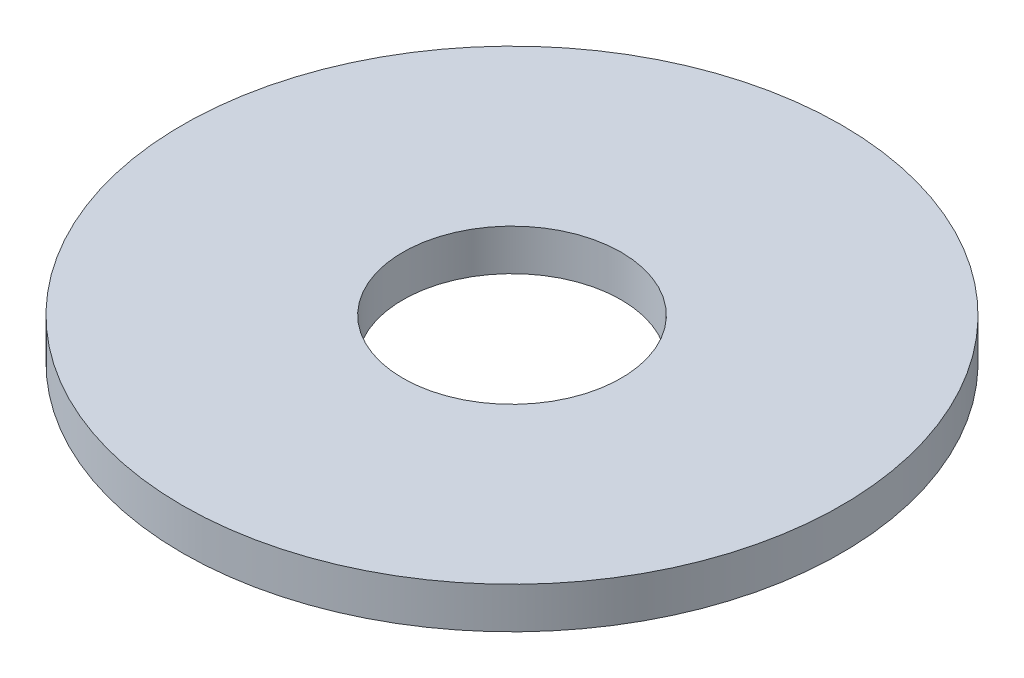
from build123d import *

# Parameters (mm, degrees)
ESQUISSE1_W = 5.35
ESQUISSE1_H = 1


with BuildPart() as part:
    # Esquisse1 → Base-R_volution (revolve)
    with BuildSketch(Plane.XY, mode=Mode.PRIVATE) as base_r_volution_sk:
        with Locations((5.325, 0.5)):
            Rectangle(ESQUISSE1_W, ESQUISSE1_H)
    revolve(base_r_volution_sk.sketch.rotate(Axis((0, 0, 0), (0, 1, 0)), 90), axis=Axis((0, 0, 0), (0, 1, 0)))


solid = part.part
